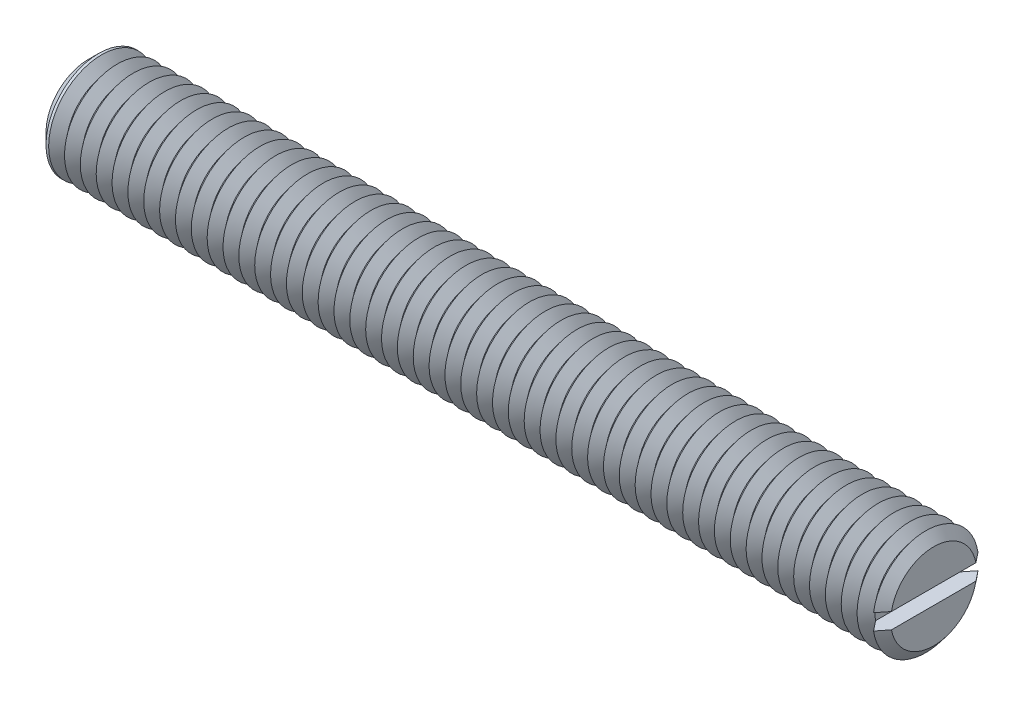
from build123d import *

# Parameters (mm, degrees)
SKETCH1_R       = 5
EXTRUDE1_DEPTH  = 40
SKETCH2_W       = 1.5
SKETCH2_H       = 1.5
EXTRUDE2_DEPTH  = 7.5
CHAMFER1_SIZE   = 1
LPATTERN1_COUNT = 53
LPATTERN1_PITCH = 1.5


with BuildPart() as part:
    # Sketch1 → Extrude1 (new, symmetric)
    with BuildSketch(Plane(origin=(0, 0, 0), x_dir=(0, 0, -1), z_dir=(1, 0, 0))):
        Circle(SKETCH1_R)
    extrude(amount=EXTRUDE1_DEPTH, both=True)

    # Sketch2 → Extrude2 (cut, symmetric)
    with BuildSketch(Plane.XY):
        with Locations((39.25, 0)):
            Rectangle(SKETCH2_W, SKETCH2_H)
    extrude(amount=EXTRUDE2_DEPTH, both=True, mode=Mode.SUBTRACT)

    # Chamfer1
    chamfer1_edges = [part.edges().sort_by_distance(p)[0] for p in [
        (-40, 0, 5),
    ]]
    chamfer(chamfer1_edges, length=CHAMFER1_SIZE)

    # Sketch3 → Cut-Revolve1 (revolve, cut)
    with BuildSketch(Plane.XY, mode=Mode.PRIVATE) as cut_revolve1_sk:
        Polygon((39.25, -5), (40.75, -5), (40, -4.0632503), align=None)
    cut_revolve1 = revolve(cut_revolve1_sk.sketch.rotate(Axis((0, 0, 0), (1, 0, 0)), 261.373073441), axis=Axis((0, 0, 0), (1, 0, 0)), mode=Mode.SUBTRACT)

    # LPattern1: Cut-Revolve1 ×53
    with Locations(*[(-i * LPATTERN1_PITCH, 0, 0) for i in range(1, LPATTERN1_COUNT)]):
        add(cut_revolve1, mode=Mode.SUBTRACT)


solid = part.part
